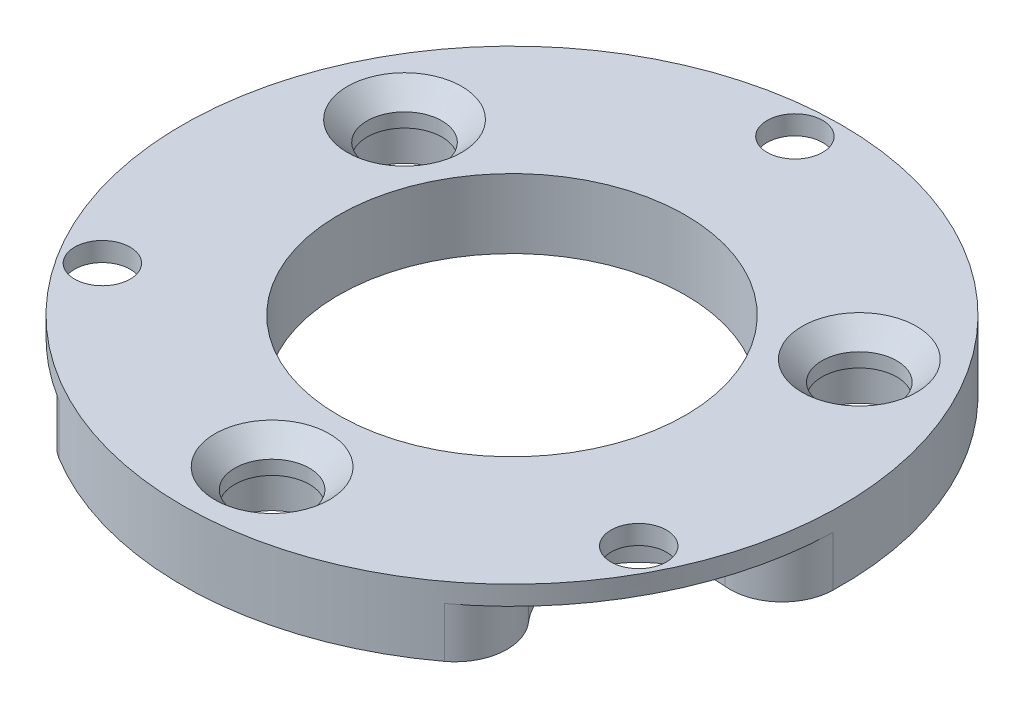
ISO-10303-21;
HEADER;
FILE_DESCRIPTION(('STEP AP214'),'2;1');
FILE_NAME('part.step','',(''),(''),'','','');
FILE_SCHEMA(('AUTOMOTIVE_DESIGN { 1 0 10303 214 1 1 1 1 }'));
ENDSEC;
DATA;
#1=APPLICATION_CONTEXT('core data for automotive mechanical design processes');
#2=APPLICATION_PROTOCOL_DEFINITION('international standard','automotive_design',2000,#1);
#3=PRODUCT_CONTEXT('',#1,'mechanical');
#4=PRODUCT('Part','Part','',(#3));
#5=PRODUCT_RELATED_PRODUCT_CATEGORY('part','',(#4));
#6=PRODUCT_DEFINITION_FORMATION('','',#4);
#7=PRODUCT_DEFINITION_CONTEXT('part definition',#1,'design');
#8=PRODUCT_DEFINITION('design','',#6,#7);
#9=PRODUCT_DEFINITION_SHAPE('','',#8);
#10=(LENGTH_UNIT() NAMED_UNIT(*) SI_UNIT(.MILLI.,.METRE.));
#11=(NAMED_UNIT(*) PLANE_ANGLE_UNIT() SI_UNIT($,.RADIAN.));
#12=(NAMED_UNIT(*) SI_UNIT($,.STERADIAN.) SOLID_ANGLE_UNIT());
#13=UNCERTAINTY_MEASURE_WITH_UNIT(LENGTH_MEASURE(1.E-05),#10,'distance_accuracy_value','');
#14=(GEOMETRIC_REPRESENTATION_CONTEXT(3) GLOBAL_UNCERTAINTY_ASSIGNED_CONTEXT((#13)) GLOBAL_UNIT_ASSIGNED_CONTEXT((#10,
#11,#12)) REPRESENTATION_CONTEXT('',''));
#15=CARTESIAN_POINT('',(0.,0.,0.));
#16=DIRECTION('',(0.,0.,1.));
#17=DIRECTION('',(1.,0.,0.));
#18=AXIS2_PLACEMENT_3D('',#15,#16,#17);
#19=CARTESIAN_POINT('',(1013.64303060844,1021.15951641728,1015.94449769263));
#20=DIRECTION('',(0.,1.,0.));
#21=DIRECTION('',(-0.842589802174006,0.,0.538555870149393));
#22=AXIS2_PLACEMENT_3D('',#19,#20,#21);
#23=CYLINDRICAL_SURFACE('',#22,2.15499999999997);
#24=CARTESIAN_POINT('',(1013.64303060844,1031.22200558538,1015.94449769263));
#25=DIRECTION('',(0.,1.,0.));
#26=DIRECTION('',(0.842589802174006,0.,-0.538555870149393));
#27=AXIS2_PLACEMENT_3D('',#24,#25,#26);
#28=CIRCLE('',#27,2.15499999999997);
#29=CARTESIAN_POINT('',(1015.45881163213,1031.22200558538,1014.78390979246));
#30=VERTEX_POINT('',#29);
#31=EDGE_CURVE('E177',#30,#30,#28,.T.);
#32=ORIENTED_EDGE('',*,*,#31,.T.);
#33=EDGE_LOOP('',(#32));
#34=FACE_BOUND('',#33,.T.);
#35=CARTESIAN_POINT('',(1013.64303060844,1030.41200558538,1015.94449769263));
#36=DIRECTION('',(0.,-1.,0.));
#37=DIRECTION('',(0.842589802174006,0.,-0.538555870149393));
#38=AXIS2_PLACEMENT_3D('',#35,#36,#37);
#39=CIRCLE('',#38,2.15499999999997);
#40=CARTESIAN_POINT('',(1015.45881163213,1030.41200558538,1014.78390979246));
#41=VERTEX_POINT('',#40);
#42=EDGE_CURVE('E262',#41,#41,#39,.T.);
#43=ORIENTED_EDGE('',*,*,#42,.T.);
#44=EDGE_LOOP('',(#43));
#45=FACE_BOUND('',#44,.T.);
#46=ADVANCED_FACE('F17',(#34,#45),#23,.F.);
#47=CARTESIAN_POINT('',(1038.73220324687,1021.15951641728,1014.81161803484));
#48=DIRECTION('',(0.,1.,0.));
#49=DIRECTION('',(-0.842589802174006,0.,0.538555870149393));
#50=AXIS2_PLACEMENT_3D('',#47,#48,#49);
#51=CYLINDRICAL_SURFACE('',#50,2.15499999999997);
#52=CARTESIAN_POINT('',(1038.73220324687,1031.22200558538,1014.81161803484));
#53=DIRECTION('',(0.,1.,0.));
#54=DIRECTION('',(0.842589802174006,0.,-0.538555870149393));
#55=AXIS2_PLACEMENT_3D('',#52,#53,#54);
#56=CIRCLE('',#55,2.15499999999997);
#57=CARTESIAN_POINT('',(1040.54798427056,1031.22200558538,1013.65103013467));
#58=VERTEX_POINT('',#57);
#59=EDGE_CURVE('E199',#58,#58,#56,.T.);
#60=ORIENTED_EDGE('',*,*,#59,.T.);
#61=EDGE_LOOP('',(#60));
#62=FACE_BOUND('',#61,.T.);
#63=CARTESIAN_POINT('',(1038.73220324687,1030.41200558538,1014.81161803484));
#64=DIRECTION('',(0.,-1.,0.));
#65=DIRECTION('',(0.842589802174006,0.,-0.538555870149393));
#66=AXIS2_PLACEMENT_3D('',#63,#64,#65);
#67=CIRCLE('',#66,2.15499999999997);
#68=CARTESIAN_POINT('',(1040.54798427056,1030.41200558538,1013.65103013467));
#69=VERTEX_POINT('',#68);
#70=EDGE_CURVE('E275',#69,#69,#67,.T.);
#71=ORIENTED_EDGE('',*,*,#70,.T.);
#72=EDGE_LOOP('',(#71));
#73=FACE_BOUND('',#72,.T.);
#74=ADVANCED_FACE('F232',(#62,#73),#51,.F.);
#75=CARTESIAN_POINT('',(1027.16871949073,1021.15951641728,1037.10591872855));
#76=DIRECTION('',(0.,1.,0.));
#77=DIRECTION('',(-0.842589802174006,0.,0.538555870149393));
#78=AXIS2_PLACEMENT_3D('',#75,#76,#77);
#79=CYLINDRICAL_SURFACE('',#78,2.15499999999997);
#80=CARTESIAN_POINT('',(1027.16871949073,1031.22200558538,1037.10591872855));
#81=DIRECTION('',(0.,1.,0.));
#82=DIRECTION('',(0.842589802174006,0.,-0.538555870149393));
#83=AXIS2_PLACEMENT_3D('',#80,#81,#82);
#84=CIRCLE('',#83,2.15499999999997);
#85=CARTESIAN_POINT('',(1028.98450051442,1031.22200558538,1035.94533082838));
#86=VERTEX_POINT('',#85);
#87=EDGE_CURVE('E181',#86,#86,#84,.T.);
#88=ORIENTED_EDGE('',*,*,#87,.T.);
#89=EDGE_LOOP('',(#88));
#90=FACE_BOUND('',#89,.T.);
#91=CARTESIAN_POINT('',(1027.16871949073,1030.41200558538,1037.10591872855));
#92=DIRECTION('',(0.,-1.,0.));
#93=DIRECTION('',(0.842589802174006,0.,-0.538555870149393));
#94=AXIS2_PLACEMENT_3D('',#91,#92,#93);
#95=CIRCLE('',#94,2.15499999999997);
#96=CARTESIAN_POINT('',(1028.98450051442,1030.41200558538,1035.94533082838));
#97=VERTEX_POINT('',#96);
#98=EDGE_CURVE('E395',#97,#97,#95,.T.);
#99=ORIENTED_EDGE('',*,*,#98,.T.);
#100=EDGE_LOOP('',(#99));
#101=FACE_BOUND('',#100,.T.);
#102=ADVANCED_FACE('F257',(#90,#101),#79,.F.);
#103=CARTESIAN_POINT('',(1026.51465111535,1039.22200558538,1022.62067815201));
#104=DIRECTION('',(0.,-1.,0.));
#105=DIRECTION('',(0.842589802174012,0.,-0.538555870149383));
#106=AXIS2_PLACEMENT_3D('',#103,#104,#105);
#107=CYLINDRICAL_SURFACE('',#106,19.);
#108=DIRECTION('',(0.,1.,0.));
#109=VECTOR('',#108,1.);
#110=CARTESIAN_POINT('',(1007.64312319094,1039.22200558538,1024.8264509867));
#111=LINE('',#110,#109);
#112=CARTESIAN_POINT('',(1007.64312319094,1028.37200558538,1024.8264509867));
#113=VERTEX_POINT('',#112);
#114=CARTESIAN_POINT('',(1007.64312319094,1031.26200558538,1024.8264509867));
#115=VERTEX_POINT('',#114);
#116=EDGE_CURVE('E11',#113,#115,#111,.T.);
#117=ORIENTED_EDGE('',*,*,#116,.T.);
#118=CARTESIAN_POINT('',(1026.51465111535,1031.26200558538,1022.62067815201));
#119=DIRECTION('',(0.,-1.,0.));
#120=DIRECTION('',(0.842589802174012,0.,-0.538555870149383));
#121=AXIS2_PLACEMENT_3D('',#118,#119,#120);
#122=CIRCLE('',#121,19.);
#123=CARTESIAN_POINT('',(1016.58833202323,1031.26200558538,1038.8215481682));
#124=VERTEX_POINT('',#123);
#125=EDGE_CURVE('E317',#124,#115,#122,.T.);
#126=ORIENTED_EDGE('',*,*,#125,.F.);
#127=DIRECTION('',(0.,-1.,0.));
#128=VECTOR('',#127,1.);
#129=CARTESIAN_POINT('',(1016.58833202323,1039.22200558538,1038.8215481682));
#130=LINE('',#129,#128);
#131=CARTESIAN_POINT('',(1016.58833202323,1028.37200558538,1038.8215481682));
#132=VERTEX_POINT('',#131);
#133=EDGE_CURVE('E309',#124,#132,#130,.T.);
#134=ORIENTED_EDGE('',*,*,#133,.T.);
#135=CARTESIAN_POINT('',(1026.51465111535,1028.37200558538,1022.62067815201));
#136=DIRECTION('',(0.,-1.,0.));
#137=DIRECTION('',(0.842589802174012,0.,-0.538555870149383));
#138=AXIS2_PLACEMENT_3D('',#135,#136,#137);
#139=CIRCLE('',#138,19.);
#140=CARTESIAN_POINT('',(1037.86067038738,1028.37200558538,1037.86101432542));
#141=VERTEX_POINT('',#140);
#142=EDGE_CURVE('E205',#141,#132,#139,.T.);
#143=ORIENTED_EDGE('',*,*,#142,.F.);
#144=DIRECTION('',(0.,1.,0.));
#145=VECTOR('',#144,1.);
#146=CARTESIAN_POINT('',(1037.86067038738,1039.22200558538,1037.86101432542));
#147=LINE('',#146,#145);
#148=CARTESIAN_POINT('',(1037.86067038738,1031.26200558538,1037.86101432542));
#149=VERTEX_POINT('',#148);
#150=EDGE_CURVE('E303',#141,#149,#147,.T.);
#151=ORIENTED_EDGE('',*,*,#150,.T.);
#152=CARTESIAN_POINT('',(1026.51465111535,1031.26200558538,1022.62067815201));
#153=DIRECTION('',(0.,-1.,0.));
#154=DIRECTION('',(0.842589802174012,0.,-0.538555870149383));
#155=AXIS2_PLACEMENT_3D('',#152,#153,#154);
#156=CIRCLE('',#155,19.);
#157=CARTESIAN_POINT('',(1045.50817565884,1031.26200558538,1023.11668764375));
#158=VERTEX_POINT('',#157);
#159=EDGE_CURVE('E325',#158,#149,#156,.T.);
#160=ORIENTED_EDGE('',*,*,#159,.F.);
#161=DIRECTION('',(0.,-1.,0.));
#162=VECTOR('',#161,1.);
#163=CARTESIAN_POINT('',(1045.50817565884,1039.22200558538,1023.11668764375));
#164=LINE('',#163,#162);
#165=CARTESIAN_POINT('',(1045.50817565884,1028.37200558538,1023.11668764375));
#166=VERTEX_POINT('',#165);
#167=EDGE_CURVE('E142',#158,#166,#164,.T.);
#168=ORIENTED_EDGE('',*,*,#167,.T.);
#169=CARTESIAN_POINT('',(1026.51465111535,1028.37200558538,1022.62067815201));
#170=DIRECTION('',(0.,-1.,0.));
#171=DIRECTION('',(0.842589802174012,0.,-0.538555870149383));
#172=AXIS2_PLACEMENT_3D('',#169,#170,#171);
#173=CIRCLE('',#172,19.);
#174=CARTESIAN_POINT('',(1034.04015976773,1028.37200558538,1005.17456914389));
#175=VERTEX_POINT('',#174);
#176=EDGE_CURVE('E133',#175,#166,#173,.T.);
#177=ORIENTED_EDGE('',*,*,#176,.F.);
#178=DIRECTION('',(0.,1.,0.));
#179=VECTOR('',#178,1.);
#180=CARTESIAN_POINT('',(1034.04015976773,1039.22200558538,1005.17456914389));
#181=LINE('',#180,#179);
#182=CARTESIAN_POINT('',(1034.04015976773,1031.26200558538,1005.17456914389));
#183=VERTEX_POINT('',#182);
#184=EDGE_CURVE('E139',#175,#183,#181,.T.);
#185=ORIENTED_EDGE('',*,*,#184,.T.);
#186=CARTESIAN_POINT('',(1026.51465111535,1031.26200558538,1022.62067815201));
#187=DIRECTION('',(0.,-1.,0.));
#188=DIRECTION('',(0.842589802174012,0.,-0.538555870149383));
#189=AXIS2_PLACEMENT_3D('',#186,#187,#188);
#190=CIRCLE('',#189,19.);
#191=CARTESIAN_POINT('',(1017.44744566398,1031.26200558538,1005.92379864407));
#192=VERTEX_POINT('',#191);
#193=EDGE_CURVE('E272',#192,#183,#190,.T.);
#194=ORIENTED_EDGE('',*,*,#193,.F.);
#195=DIRECTION('',(0.,-1.,0.));
#196=VECTOR('',#195,1.);
#197=CARTESIAN_POINT('',(1017.44744566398,1039.22200558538,1005.92379864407));
#198=LINE('',#197,#196);
#199=CARTESIAN_POINT('',(1017.44744566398,1028.37200558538,1005.92379864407));
#200=VERTEX_POINT('',#199);
#201=EDGE_CURVE('E26',#192,#200,#198,.T.);
#202=ORIENTED_EDGE('',*,*,#201,.T.);
#203=CARTESIAN_POINT('',(1026.51465111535,1028.37200558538,1022.62067815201));
#204=DIRECTION('',(0.,-1.,0.));
#205=DIRECTION('',(0.842589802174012,0.,-0.538555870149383));
#206=AXIS2_PLACEMENT_3D('',#203,#204,#205);
#207=CIRCLE('',#206,19.);
#208=EDGE_CURVE('E173',#113,#200,#207,.T.);
#209=ORIENTED_EDGE('',*,*,#208,.F.);
#210=EDGE_LOOP('',(#117,#126,#134,#143,#151,#160,#168,#177,#185,#194,#202,#209));
#211=FACE_BOUND('',#210,.T.);
#212=CARTESIAN_POINT('',(1026.51465111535,1032.36700558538,1022.62067815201));
#213=DIRECTION('',(0.,1.,0.));
#214=DIRECTION('',(-0.842589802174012,0.,0.538555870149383));
#215=AXIS2_PLACEMENT_3D('',#212,#213,#214);
#216=CIRCLE('',#215,19.);
#217=CARTESIAN_POINT('',(1010.50544487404,1032.36700558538,1032.85323968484));
#218=VERTEX_POINT('',#217);
#219=EDGE_CURVE('E190',#218,#218,#216,.T.);
#220=ORIENTED_EDGE('',*,*,#219,.F.);
#221=EDGE_LOOP('',(#220));
#222=FACE_BOUND('',#221,.T.);
#223=ADVANCED_FACE('F135',(#211,#222),#107,.T.);
#224=CARTESIAN_POINT('',(1025.74330151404,1032.36700558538,1005.53808409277));
#225=DIRECTION('',(0.,-1.,0.));
#226=DIRECTION('',(0.842589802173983,0.,-0.538555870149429));
#227=AXIS2_PLACEMENT_3D('',#224,#225,#226);
#228=CYLINDRICAL_SURFACE('',#227,1.59999999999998);
#229=CARTESIAN_POINT('',(1025.74330151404,1031.26200558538,1005.53808409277));
#230=DIRECTION('',(0.,-1.,0.));
#231=DIRECTION('',(0.842589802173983,0.,-0.538555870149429));
#232=AXIS2_PLACEMENT_3D('',#229,#230,#231);
#233=CIRCLE('',#232,1.59999999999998);
#234=CARTESIAN_POINT('',(1027.09144519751,1031.26200558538,1004.67639470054));
#235=VERTEX_POINT('',#234);
#236=EDGE_CURVE('E298',#235,#235,#233,.T.);
#237=ORIENTED_EDGE('',*,*,#236,.T.);
#238=EDGE_LOOP('',(#237));
#239=FACE_BOUND('',#238,.T.);
#240=CARTESIAN_POINT('',(1025.74330151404,1032.36700558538,1005.53808409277));
#241=DIRECTION('',(0.,1.,0.));
#242=DIRECTION('',(-0.842589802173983,0.,0.538555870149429));
#243=AXIS2_PLACEMENT_3D('',#240,#241,#242);
#244=CIRCLE('',#243,1.59999999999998);
#245=CARTESIAN_POINT('',(1024.39515783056,1032.36700558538,1006.39977348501));
#246=VERTEX_POINT('',#245);
#247=EDGE_CURVE('E182',#246,#246,#244,.T.);
#248=ORIENTED_EDGE('',*,*,#247,.T.);
#249=EDGE_LOOP('',(#248));
#250=FACE_BOUND('',#249,.T.);
#251=ADVANCED_FACE('F743',(#239,#250),#228,.F.);
#252=CARTESIAN_POINT('',(1012.10636549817,1032.36700558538,1031.82998353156));
#253=DIRECTION('',(0.,-1.,0.));
#254=DIRECTION('',(0.842589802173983,0.,-0.538555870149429));
#255=AXIS2_PLACEMENT_3D('',#252,#253,#254);
#256=CYLINDRICAL_SURFACE('',#255,1.59999999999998);
#257=CARTESIAN_POINT('',(1012.10636549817,1031.26200558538,1031.82998353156));
#258=DIRECTION('',(0.,-1.,0.));
#259=DIRECTION('',(0.842589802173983,0.,-0.538555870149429));
#260=AXIS2_PLACEMENT_3D('',#257,#258,#259);
#261=CIRCLE('',#260,1.59999999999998);
#262=CARTESIAN_POINT('',(1013.45450918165,1031.26200558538,1030.96829413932));
#263=VERTEX_POINT('',#262);
#264=EDGE_CURVE('E337',#263,#263,#261,.T.);
#265=ORIENTED_EDGE('',*,*,#264,.T.);
#266=EDGE_LOOP('',(#265));
#267=FACE_BOUND('',#266,.T.);
#268=CARTESIAN_POINT('',(1012.10636549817,1032.36700558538,1031.82998353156));
#269=DIRECTION('',(0.,1.,0.));
#270=DIRECTION('',(-0.842589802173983,0.,0.538555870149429));
#271=AXIS2_PLACEMENT_3D('',#268,#269,#270);
#272=CIRCLE('',#271,1.59999999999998);
#273=CARTESIAN_POINT('',(1010.7582218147,1032.36700558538,1032.6916729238));
#274=VERTEX_POINT('',#273);
#275=EDGE_CURVE('E222',#274,#274,#272,.T.);
#276=ORIENTED_EDGE('',*,*,#275,.T.);
#277=EDGE_LOOP('',(#276));
#278=FACE_BOUND('',#277,.T.);
#279=ADVANCED_FACE('F249',(#267,#278),#256,.F.);
#280=CARTESIAN_POINT('',(1041.69428633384,1032.36700558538,1030.49396683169));
#281=DIRECTION('',(0.,-1.,0.));
#282=DIRECTION('',(0.842589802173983,0.,-0.538555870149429));
#283=AXIS2_PLACEMENT_3D('',#280,#281,#282);
#284=CYLINDRICAL_SURFACE('',#283,1.59999999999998);
#285=CARTESIAN_POINT('',(1041.69428633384,1031.26200558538,1030.49396683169));
#286=DIRECTION('',(0.,-1.,0.));
#287=DIRECTION('',(0.842589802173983,0.,-0.538555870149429));
#288=AXIS2_PLACEMENT_3D('',#285,#286,#287);
#289=CIRCLE('',#288,1.59999999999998);
#290=CARTESIAN_POINT('',(1043.04243001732,1031.26200558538,1029.63227743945));
#291=VERTEX_POINT('',#290);
#292=EDGE_CURVE('E357',#291,#291,#289,.T.);
#293=ORIENTED_EDGE('',*,*,#292,.T.);
#294=EDGE_LOOP('',(#293));
#295=FACE_BOUND('',#294,.T.);
#296=CARTESIAN_POINT('',(1041.69428633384,1032.36700558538,1030.49396683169));
#297=DIRECTION('',(0.,1.,0.));
#298=DIRECTION('',(-0.842589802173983,0.,0.538555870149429));
#299=AXIS2_PLACEMENT_3D('',#296,#297,#298);
#300=CIRCLE('',#299,1.59999999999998);
#301=CARTESIAN_POINT('',(1040.34614265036,1032.36700558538,1031.35565622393));
#302=VERTEX_POINT('',#301);
#303=EDGE_CURVE('E218',#302,#302,#300,.T.);
#304=ORIENTED_EDGE('',*,*,#303,.T.);
#305=EDGE_LOOP('',(#304));
#306=FACE_BOUND('',#305,.T.);
#307=ADVANCED_FACE('F238',(#295,#306),#284,.F.);
#308=CARTESIAN_POINT('',(1038.73220324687,1032.36700558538,1014.81161803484));
#309=DIRECTION('',(0.,1.,0.));
#310=DIRECTION('',(-0.842589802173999,0.,0.538555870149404));
#311=AXIS2_PLACEMENT_3D('',#308,#309,#310);
#312=CONICAL_SURFACE('',#311,3.3,0.785398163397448);
#313=CARTESIAN_POINT('',(1038.73220324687,1032.36700558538,1014.81161803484));
#314=DIRECTION('',(0.,1.,0.));
#315=DIRECTION('',(-0.842589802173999,0.,0.538555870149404));
#316=AXIS2_PLACEMENT_3D('',#313,#314,#315);
#317=CIRCLE('',#316,3.3);
#318=CARTESIAN_POINT('',(1035.9516568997,1032.36700558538,1016.58885240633));
#319=VERTEX_POINT('',#318);
#320=EDGE_CURVE('E185',#319,#319,#317,.T.);
#321=ORIENTED_EDGE('',*,*,#320,.T.);
#322=EDGE_LOOP('',(#321));
#323=FACE_BOUND('',#322,.T.);
#324=ORIENTED_EDGE('',*,*,#59,.F.);
#325=EDGE_LOOP('',(#324));
#326=FACE_BOUND('',#325,.T.);
#327=ADVANCED_FACE('F235',(#323,#326),#312,.F.);
#328=CARTESIAN_POINT('',(1027.16871949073,1032.36700558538,1037.10591872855));
#329=DIRECTION('',(0.,1.,0.));
#330=DIRECTION('',(-0.842589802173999,0.,0.538555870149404));
#331=AXIS2_PLACEMENT_3D('',#328,#329,#330);
#332=CONICAL_SURFACE('',#331,3.3,0.785398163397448);
#333=CARTESIAN_POINT('',(1027.16871949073,1032.36700558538,1037.10591872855));
#334=DIRECTION('',(0.,1.,0.));
#335=DIRECTION('',(-0.842589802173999,0.,0.538555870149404));
#336=AXIS2_PLACEMENT_3D('',#333,#334,#335);
#337=CIRCLE('',#336,3.3);
#338=CARTESIAN_POINT('',(1024.38817314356,1032.36700558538,1038.88315310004));
#339=VERTEX_POINT('',#338);
#340=EDGE_CURVE('E189',#339,#339,#337,.T.);
#341=ORIENTED_EDGE('',*,*,#340,.T.);
#342=EDGE_LOOP('',(#341));
#343=FACE_BOUND('',#342,.T.);
#344=ORIENTED_EDGE('',*,*,#87,.F.);
#345=EDGE_LOOP('',(#344));
#346=FACE_BOUND('',#345,.T.);
#347=ADVANCED_FACE('F237',(#343,#346),#332,.F.);
#348=CARTESIAN_POINT('',(1013.64303060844,1032.36700558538,1015.94449769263));
#349=DIRECTION('',(0.,1.,0.));
#350=DIRECTION('',(-0.842589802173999,0.,0.538555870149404));
#351=AXIS2_PLACEMENT_3D('',#348,#349,#350);
#352=CONICAL_SURFACE('',#351,3.3,0.785398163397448);
#353=CARTESIAN_POINT('',(1013.64303060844,1032.36700558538,1015.94449769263));
#354=DIRECTION('',(0.,1.,0.));
#355=DIRECTION('',(-0.842589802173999,0.,0.538555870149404));
#356=AXIS2_PLACEMENT_3D('',#353,#354,#355);
#357=CIRCLE('',#356,3.3);
#358=CARTESIAN_POINT('',(1010.86248426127,1032.36700558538,1017.72173206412));
#359=VERTEX_POINT('',#358);
#360=EDGE_CURVE('E217',#359,#359,#357,.T.);
#361=ORIENTED_EDGE('',*,*,#360,.T.);
#362=EDGE_LOOP('',(#361));
#363=FACE_BOUND('',#362,.T.);
#364=ORIENTED_EDGE('',*,*,#31,.F.);
#365=EDGE_LOOP('',(#364));
#366=FACE_BOUND('',#365,.T.);
#367=ADVANCED_FACE('F246',(#363,#366),#352,.F.);
#368=CARTESIAN_POINT('',(1026.51465111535,1032.36700558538,1022.62067815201));
#369=DIRECTION('',(0.,1.,0.));
#370=DIRECTION('',(1.,0.,0.));
#371=AXIS2_PLACEMENT_3D('',#368,#369,#370);
#372=PLANE('',#371);
#373=ORIENTED_EDGE('',*,*,#247,.F.);
#374=EDGE_LOOP('',(#373));
#375=FACE_BOUND('',#374,.T.);
#376=ORIENTED_EDGE('',*,*,#275,.F.);
#377=EDGE_LOOP('',(#376));
#378=FACE_BOUND('',#377,.T.);
#379=ORIENTED_EDGE('',*,*,#303,.F.);
#380=EDGE_LOOP('',(#379));
#381=FACE_BOUND('',#380,.T.);
#382=CARTESIAN_POINT('',(1026.51465111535,1032.36700558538,1022.62067815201));
#383=DIRECTION('',(0.,1.,0.));
#384=DIRECTION('',(-0.84258980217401,0.,0.538555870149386));
#385=AXIS2_PLACEMENT_3D('',#382,#383,#384);
#386=CIRCLE('',#385,10.0000000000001);
#387=CARTESIAN_POINT('',(1018.08875309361,1032.36700558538,1028.0062368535));
#388=VERTEX_POINT('',#387);
#389=EDGE_CURVE('E206',#388,#388,#386,.T.);
#390=ORIENTED_EDGE('',*,*,#389,.F.);
#391=EDGE_LOOP('',(#390));
#392=FACE_BOUND('',#391,.T.);
#393=ORIENTED_EDGE('',*,*,#360,.F.);
#394=EDGE_LOOP('',(#393));
#395=FACE_BOUND('',#394,.T.);
#396=ORIENTED_EDGE('',*,*,#340,.F.);
#397=EDGE_LOOP('',(#396));
#398=FACE_BOUND('',#397,.T.);
#399=ORIENTED_EDGE('',*,*,#320,.F.);
#400=EDGE_LOOP('',(#399));
#401=FACE_BOUND('',#400,.T.);
#402=ORIENTED_EDGE('',*,*,#219,.T.);
#403=EDGE_LOOP('',(#402));
#404=FACE_BOUND('',#403,.T.);
#405=ADVANCED_FACE('F724',(#375,#378,#381,#392,#395,#398,#401,#404),#372,.T.);
#406=CARTESIAN_POINT('',(1026.51465111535,1032.36700558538,1022.62067815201));
#407=DIRECTION('',(0.,-1.,0.));
#408=DIRECTION('',(0.84258980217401,0.,-0.538555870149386));
#409=AXIS2_PLACEMENT_3D('',#406,#407,#408);
#410=CYLINDRICAL_SURFACE('',#409,10.0000000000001);
#411=CARTESIAN_POINT('',(1026.51465111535,1028.37200558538,1022.62067815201));
#412=DIRECTION('',(0.,1.,0.));
#413=DIRECTION('',(0.84258980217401,0.,-0.538555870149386));
#414=AXIS2_PLACEMENT_3D('',#411,#412,#413);
#415=CIRCLE('',#414,10.0000000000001);
#416=CARTESIAN_POINT('',(1034.94054913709,1028.37200558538,1017.23511945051));
#417=VERTEX_POINT('',#416);
#418=EDGE_CURVE('E210',#417,#417,#415,.T.);
#419=ORIENTED_EDGE('',*,*,#418,.F.);
#420=EDGE_LOOP('',(#419));
#421=FACE_BOUND('',#420,.T.);
#422=ORIENTED_EDGE('',*,*,#389,.T.);
#423=EDGE_LOOP('',(#422));
#424=FACE_BOUND('',#423,.T.);
#425=ADVANCED_FACE('F720',(#421,#424),#410,.F.);
#426=CARTESIAN_POINT('',(1025.74330151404,1031.22200558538,1005.53808409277));
#427=DIRECTION('',(0.,-1.,0.));
#428=DIRECTION('',(0.842589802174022,0.,-0.538555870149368));
#429=AXIS2_PLACEMENT_3D('',#426,#427,#428);
#430=CYLINDRICAL_SURFACE('',#429,4.5);
#431=CARTESIAN_POINT('',(1025.74330151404,1028.37200558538,1005.53808409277));
#432=DIRECTION('',(0.,1.,0.));
#433=DIRECTION('',(0.842589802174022,0.,-0.538555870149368));
#434=AXIS2_PLACEMENT_3D('',#431,#432,#433);
#435=CIRCLE('',#434,4.5);
#436=CARTESIAN_POINT('',(1021.62478641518,1028.37200558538,1007.35132246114));
#437=VERTEX_POINT('',#436);
#438=CARTESIAN_POINT('',(1030.00847354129,1028.37200558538,1006.9727643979));
#439=VERTEX_POINT('',#438);
#440=EDGE_CURVE('E148',#437,#439,#435,.T.);
#441=ORIENTED_EDGE('',*,*,#440,.F.);
#442=DIRECTION('',(0.,1.,0.));
#443=VECTOR('',#442,1.);
#444=CARTESIAN_POINT('',(1021.62478641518,1031.22200558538,1007.35132246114));
#445=LINE('',#444,#443);
#446=CARTESIAN_POINT('',(1021.62478641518,1031.26200558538,1007.35132246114));
#447=VERTEX_POINT('',#446);
#448=EDGE_CURVE('E157',#437,#447,#445,.T.);
#449=ORIENTED_EDGE('',*,*,#448,.T.);
#450=CARTESIAN_POINT('',(1025.74330151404,1031.26200558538,1005.53808409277));
#451=DIRECTION('',(0.,-1.,0.));
#452=DIRECTION('',(0.842589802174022,0.,-0.538555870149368));
#453=AXIS2_PLACEMENT_3D('',#450,#451,#452);
#454=CIRCLE('',#453,4.5);
#455=CARTESIAN_POINT('',(1030.00847354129,1031.26200558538,1006.9727643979));
#456=VERTEX_POINT('',#455);
#457=EDGE_CURVE('E292',#456,#447,#454,.T.);
#458=ORIENTED_EDGE('',*,*,#457,.F.);
#459=DIRECTION('',(0.,-1.,0.));
#460=VECTOR('',#459,1.);
#461=CARTESIAN_POINT('',(1030.00847354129,1031.22200558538,1006.9727643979));
#462=LINE('',#461,#460);
#463=EDGE_CURVE('E164',#456,#439,#462,.T.);
#464=ORIENTED_EDGE('',*,*,#463,.T.);
#465=EDGE_LOOP('',(#441,#449,#458,#464));
#466=FACE_BOUND('',#465,.T.);
#467=ADVANCED_FACE('F716',(#466),#430,.F.);
#468=CARTESIAN_POINT('',(1041.69428633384,1031.22200558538,1030.49396683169));
#469=DIRECTION('',(0.,-1.,0.));
#470=DIRECTION('',(0.842589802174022,0.,-0.538555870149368));
#471=AXIS2_PLACEMENT_3D('',#468,#469,#470);
#472=CYLINDRICAL_SURFACE('',#471,4.5);
#473=DIRECTION('',(0.,1.,0.));
#474=VECTOR('',#473,1.);
#475=CARTESIAN_POINT('',(1042.18323339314,1031.22200558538,1026.02060894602));
#476=LINE('',#475,#474);
#477=CARTESIAN_POINT('',(1042.18323339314,1028.37200558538,1026.02060894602));
#478=VERTEX_POINT('',#477);
#479=CARTESIAN_POINT('',(1042.18323339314,1031.26200558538,1026.02060894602));
#480=VERTEX_POINT('',#479);
#481=EDGE_CURVE('E304',#478,#480,#476,.T.);
#482=ORIENTED_EDGE('',*,*,#481,.T.);
#483=CARTESIAN_POINT('',(1041.69428633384,1031.26200558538,1030.49396683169));
#484=DIRECTION('',(0.,-1.,0.));
#485=DIRECTION('',(0.842589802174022,0.,-0.538555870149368));
#486=AXIS2_PLACEMENT_3D('',#483,#484,#485);
#487=CIRCLE('',#486,4.5);
#488=CARTESIAN_POINT('',(1038.31923072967,1031.26200558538,1033.47037400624));
#489=VERTEX_POINT('',#488);
#490=EDGE_CURVE('E341',#489,#480,#487,.T.);
#491=ORIENTED_EDGE('',*,*,#490,.F.);
#492=DIRECTION('',(0.,-1.,0.));
#493=VECTOR('',#492,1.);
#494=CARTESIAN_POINT('',(1038.31923072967,1031.22200558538,1033.47037400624));
#495=LINE('',#494,#493);
#496=CARTESIAN_POINT('',(1038.31923072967,1028.37200558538,1033.47037400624));
#497=VERTEX_POINT('',#496);
#498=EDGE_CURVE('E299',#489,#497,#495,.T.);
#499=ORIENTED_EDGE('',*,*,#498,.T.);
#500=CARTESIAN_POINT('',(1041.69428633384,1028.37200558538,1030.49396683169));
#501=DIRECTION('',(0.,1.,0.));
#502=DIRECTION('',(0.842589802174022,0.,-0.538555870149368));
#503=AXIS2_PLACEMENT_3D('',#500,#501,#502);
#504=CIRCLE('',#503,4.5);
#505=EDGE_CURVE('E147',#478,#497,#504,.T.);
#506=ORIENTED_EDGE('',*,*,#505,.F.);
#507=EDGE_LOOP('',(#482,#491,#499,#506));
#508=FACE_BOUND('',#507,.T.);
#509=ADVANCED_FACE('F713',(#508),#472,.F.);
#510=CARTESIAN_POINT('',(1012.10636549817,1031.22200558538,1031.82998353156));
#511=DIRECTION('',(0.,-1.,0.));
#512=DIRECTION('',(0.842589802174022,0.,-0.538555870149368));
#513=AXIS2_PLACEMENT_3D('',#510,#511,#512);
#514=CYLINDRICAL_SURFACE('',#513,4.5);
#515=DIRECTION('',(0.,-1.,0.));
#516=VECTOR('',#515,1.);
#517=CARTESIAN_POINT('',(1011.21624907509,1031.22200558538,1027.41889605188));
#518=LINE('',#517,#516);
#519=CARTESIAN_POINT('',(1011.21624907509,1031.26200558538,1027.41889605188));
#520=VERTEX_POINT('',#519);
#521=CARTESIAN_POINT('',(1011.21624907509,1028.37200558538,1027.41889605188));
#522=VERTEX_POINT('',#521);
#523=EDGE_CURVE('E324',#520,#522,#518,.T.);
#524=ORIENTED_EDGE('',*,*,#523,.T.);
#525=CARTESIAN_POINT('',(1012.10636549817,1028.37200558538,1031.82998353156));
#526=DIRECTION('',(0.,1.,0.));
#527=DIRECTION('',(0.842589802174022,0.,-0.538555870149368));
#528=AXIS2_PLACEMENT_3D('',#525,#526,#527);
#529=CIRCLE('',#528,4.5);
#530=CARTESIAN_POINT('',(1015.73593353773,1028.37200558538,1034.49010304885));
#531=VERTEX_POINT('',#530);
#532=EDGE_CURVE('E285',#531,#522,#529,.T.);
#533=ORIENTED_EDGE('',*,*,#532,.F.);
#534=DIRECTION('',(0.,1.,0.));
#535=VECTOR('',#534,1.);
#536=CARTESIAN_POINT('',(1015.73593353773,1031.22200558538,1034.49010304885));
#537=LINE('',#536,#535);
#538=CARTESIAN_POINT('',(1015.73593353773,1031.26200558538,1034.49010304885));
#539=VERTEX_POINT('',#538);
#540=EDGE_CURVE('E170',#531,#539,#537,.T.);
#541=ORIENTED_EDGE('',*,*,#540,.T.);
#542=CARTESIAN_POINT('',(1012.10636549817,1031.26200558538,1031.82998353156));
#543=DIRECTION('',(0.,-1.,0.));
#544=DIRECTION('',(0.842589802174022,0.,-0.538555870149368));
#545=AXIS2_PLACEMENT_3D('',#542,#543,#544);
#546=CIRCLE('',#545,4.5);
#547=EDGE_CURVE('E334',#520,#539,#546,.T.);
#548=ORIENTED_EDGE('',*,*,#547,.F.);
#549=EDGE_LOOP('',(#524,#533,#541,#548));
#550=FACE_BOUND('',#549,.T.);
#551=ADVANCED_FACE('F407',(#550),#514,.F.);
#552=CARTESIAN_POINT('',(1026.51465111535,1028.37200558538,1022.62067815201));
#553=DIRECTION('',(0.,-1.,0.));
#554=DIRECTION('',(0.,0.,-1.));
#555=AXIS2_PLACEMENT_3D('',#552,#553,#554);
#556=PLANE('',#555);
#557=CARTESIAN_POINT('',(1013.64303060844,1028.37200558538,1015.94449769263));
#558=DIRECTION('',(0.,-1.,0.));
#559=DIRECTION('',(0.842589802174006,0.,-0.538555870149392));
#560=AXIS2_PLACEMENT_3D('',#557,#558,#559);
#561=CIRCLE('',#560,2.55000000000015);
#562=CARTESIAN_POINT('',(1015.79163460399,1028.37200558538,1014.57118022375));
#563=VERTEX_POINT('',#562);
#564=EDGE_CURVE('E196',#563,#563,#561,.T.);
#565=ORIENTED_EDGE('',*,*,#564,.F.);
#566=EDGE_LOOP('',(#565));
#567=FACE_BOUND('',#566,.T.);
#568=CARTESIAN_POINT('',(1027.16871949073,1028.37200558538,1037.10591872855));
#569=DIRECTION('',(0.,-1.,0.));
#570=DIRECTION('',(0.842589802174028,0.,-0.538555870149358));
#571=AXIS2_PLACEMENT_3D('',#568,#569,#570);
#572=CIRCLE('',#571,2.55000000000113);
#573=CARTESIAN_POINT('',(1029.31732348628,1028.37200558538,1035.73260125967));
#574=VERTEX_POINT('',#573);
#575=EDGE_CURVE('E195',#574,#574,#572,.T.);
#576=ORIENTED_EDGE('',*,*,#575,.F.);
#577=EDGE_LOOP('',(#576));
#578=FACE_BOUND('',#577,.T.);
#579=CARTESIAN_POINT('',(1038.73220324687,1028.37200558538,1014.81161803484));
#580=DIRECTION('',(0.,-1.,0.));
#581=DIRECTION('',(0.842589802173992,0.,-0.538555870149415));
#582=AXIS2_PLACEMENT_3D('',#579,#580,#581);
#583=CIRCLE('',#582,2.55000000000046);
#584=CARTESIAN_POINT('',(1040.88080724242,1028.37200558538,1013.43830056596));
#585=VERTEX_POINT('',#584);
#586=EDGE_CURVE('E191',#585,#585,#583,.T.);
#587=ORIENTED_EDGE('',*,*,#586,.F.);
#588=EDGE_LOOP('',(#587));
#589=FACE_BOUND('',#588,.T.);
#590=ORIENTED_EDGE('',*,*,#418,.T.);
#591=EDGE_LOOP('',(#590));
#592=FACE_BOUND('',#591,.T.);
#593=ORIENTED_EDGE('',*,*,#208,.T.);
#594=CARTESIAN_POINT('',(1018.87910968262,1028.37200558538,1008.56014804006));
#595=DIRECTION('',(0.,-1.,0.));
#596=DIRECTION('',(0.842589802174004,0.,-0.538555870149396));
#597=AXIS2_PLACEMENT_3D('',#594,#595,#596);
#598=CIRCLE('',#597,3.);
#599=EDGE_CURVE('E39',#200,#437,#598,.T.);
#600=ORIENTED_EDGE('',*,*,#599,.T.);
#601=ORIENTED_EDGE('',*,*,#440,.T.);
#602=CARTESIAN_POINT('',(1032.85192155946,1028.37200558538,1007.92921793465));
#603=DIRECTION('',(0.,-1.,0.));
#604=DIRECTION('',(0.842589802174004,0.,-0.538555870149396));
#605=AXIS2_PLACEMENT_3D('',#602,#603,#604);
#606=CIRCLE('',#605,3.);
#607=EDGE_CURVE('E151',#439,#175,#606,.T.);
#608=ORIENTED_EDGE('',*,*,#607,.T.);
#609=ORIENTED_EDGE('',*,*,#176,.T.);
#610=CARTESIAN_POINT('',(1042.50919809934,1028.37200558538,1023.03837035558));
#611=DIRECTION('',(0.,-1.,0.));
#612=DIRECTION('',(0.842589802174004,0.,-0.538555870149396));
#613=AXIS2_PLACEMENT_3D('',#610,#611,#612);
#614=CIRCLE('',#613,3.);
#615=EDGE_CURVE('E361',#166,#478,#614,.T.);
#616=ORIENTED_EDGE('',*,*,#615,.T.);
#617=ORIENTED_EDGE('',*,*,#505,.T.);
#618=CARTESIAN_POINT('',(1036.06919366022,1028.37200558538,1035.45464545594));
#619=DIRECTION('',(0.,-1.,0.));
#620=DIRECTION('',(0.842589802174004,0.,-0.538555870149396));
#621=AXIS2_PLACEMENT_3D('',#618,#619,#620);
#622=CIRCLE('',#621,3.);
#623=EDGE_CURVE('E370',#497,#141,#622,.T.);
#624=ORIENTED_EDGE('',*,*,#623,.T.);
#625=ORIENTED_EDGE('',*,*,#142,.T.);
#626=CARTESIAN_POINT('',(1018.15564556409,1028.37200558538,1036.26351606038));
#627=DIRECTION('',(0.,-1.,0.));
#628=DIRECTION('',(0.842589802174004,0.,-0.538555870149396));
#629=AXIS2_PLACEMENT_3D('',#626,#627,#628);
#630=CIRCLE('',#629,3.);
#631=EDGE_CURVE('E313',#132,#531,#630,.T.);
#632=ORIENTED_EDGE('',*,*,#631,.T.);
#633=ORIENTED_EDGE('',*,*,#532,.T.);
#634=CARTESIAN_POINT('',(1010.62283812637,1028.37200558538,1024.47817106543));
#635=DIRECTION('',(0.,-1.,0.));
#636=DIRECTION('',(0.842589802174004,0.,-0.538555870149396));
#637=AXIS2_PLACEMENT_3D('',#634,#635,#636);
#638=CIRCLE('',#637,3.);
#639=EDGE_CURVE('E374',#522,#113,#638,.T.);
#640=ORIENTED_EDGE('',*,*,#639,.T.);
#641=EDGE_LOOP('',(#593,#600,#601,#608,#609,#616,#617,#624,#625,#632,#633,#640));
#642=FACE_BOUND('',#641,.T.);
#643=ADVANCED_FACE('F153',(#567,#578,#589,#592,#642),#556,.T.);
#644=CARTESIAN_POINT('',(1027.16871949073,1030.37200558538,1037.10591872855));
#645=DIRECTION('',(0.,-1.,0.));
#646=DIRECTION('',(0.842589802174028,0.,-0.538555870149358));
#647=AXIS2_PLACEMENT_3D('',#644,#645,#646);
#648=CYLINDRICAL_SURFACE('',#647,2.55000000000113);
#649=ORIENTED_EDGE('',*,*,#575,.T.);
#650=EDGE_LOOP('',(#649));
#651=FACE_BOUND('',#650,.T.);
#652=CARTESIAN_POINT('',(1027.16871949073,1030.41200558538,1037.10591872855));
#653=DIRECTION('',(0.,-1.,0.));
#654=DIRECTION('',(0.842589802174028,0.,-0.538555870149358));
#655=AXIS2_PLACEMENT_3D('',#652,#653,#654);
#656=CIRCLE('',#655,2.55000000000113);
#657=CARTESIAN_POINT('',(1029.31732348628,1030.41200558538,1035.73260125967));
#658=VERTEX_POINT('',#657);
#659=EDGE_CURVE('E641',#658,#658,#656,.T.);
#660=ORIENTED_EDGE('',*,*,#659,.F.);
#661=EDGE_LOOP('',(#660));
#662=FACE_BOUND('',#661,.T.);
#663=ADVANCED_FACE('F695',(#651,#662),#648,.F.);
#664=CARTESIAN_POINT('',(1038.73220324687,1030.37200558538,1014.81161803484));
#665=DIRECTION('',(0.,-1.,0.));
#666=DIRECTION('',(0.842589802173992,0.,-0.538555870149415));
#667=AXIS2_PLACEMENT_3D('',#664,#665,#666);
#668=CYLINDRICAL_SURFACE('',#667,2.55000000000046);
#669=ORIENTED_EDGE('',*,*,#586,.T.);
#670=EDGE_LOOP('',(#669));
#671=FACE_BOUND('',#670,.T.);
#672=CARTESIAN_POINT('',(1038.73220324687,1030.41200558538,1014.81161803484));
#673=DIRECTION('',(0.,-1.,0.));
#674=DIRECTION('',(0.842589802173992,0.,-0.538555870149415));
#675=AXIS2_PLACEMENT_3D('',#672,#673,#674);
#676=CIRCLE('',#675,2.55000000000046);
#677=CARTESIAN_POINT('',(1040.88080724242,1030.41200558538,1013.43830056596));
#678=VERTEX_POINT('',#677);
#679=EDGE_CURVE('E391',#678,#678,#676,.T.);
#680=ORIENTED_EDGE('',*,*,#679,.F.);
#681=EDGE_LOOP('',(#680));
#682=FACE_BOUND('',#681,.T.);
#683=ADVANCED_FACE('F697',(#671,#682),#668,.F.);
#684=CARTESIAN_POINT('',(1013.64303060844,1030.37200558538,1015.94449769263));
#685=DIRECTION('',(0.,-1.,0.));
#686=DIRECTION('',(0.842589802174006,0.,-0.538555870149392));
#687=AXIS2_PLACEMENT_3D('',#684,#685,#686);
#688=CYLINDRICAL_SURFACE('',#687,2.55000000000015);
#689=ORIENTED_EDGE('',*,*,#564,.T.);
#690=EDGE_LOOP('',(#689));
#691=FACE_BOUND('',#690,.T.);
#692=CARTESIAN_POINT('',(1013.64303060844,1030.41200558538,1015.94449769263));
#693=DIRECTION('',(0.,-1.,0.));
#694=DIRECTION('',(0.842589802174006,0.,-0.538555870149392));
#695=AXIS2_PLACEMENT_3D('',#692,#693,#694);
#696=CIRCLE('',#695,2.55000000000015);
#697=CARTESIAN_POINT('',(1015.79163460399,1030.41200558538,1014.57118022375));
#698=VERTEX_POINT('',#697);
#699=EDGE_CURVE('E266',#698,#698,#696,.T.);
#700=ORIENTED_EDGE('',*,*,#699,.F.);
#701=EDGE_LOOP('',(#700));
#702=FACE_BOUND('',#701,.T.);
#703=ADVANCED_FACE('F704',(#691,#702),#688,.F.);
#704=CARTESIAN_POINT('',(1018.87910968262,1039.22200558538,1008.56014804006));
#705=DIRECTION('',(0.,-1.,0.));
#706=DIRECTION('',(0.842589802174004,0.,-0.538555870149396));
#707=AXIS2_PLACEMENT_3D('',#704,#705,#706);
#708=CYLINDRICAL_SURFACE('',#707,3.);
#709=ORIENTED_EDGE('',*,*,#599,.F.);
#710=ORIENTED_EDGE('',*,*,#201,.F.);
#711=CARTESIAN_POINT('',(1018.87910968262,1031.26200558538,1008.56014804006));
#712=DIRECTION('',(0.,1.,0.));
#713=DIRECTION('',(0.842589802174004,0.,-0.538555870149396));
#714=AXIS2_PLACEMENT_3D('',#711,#712,#713);
#715=CIRCLE('',#714,3.);
#716=EDGE_CURVE('E265',#447,#192,#715,.T.);
#717=ORIENTED_EDGE('',*,*,#716,.F.);
#718=ORIENTED_EDGE('',*,*,#448,.F.);
#719=EDGE_LOOP('',(#709,#710,#717,#718));
#720=FACE_BOUND('',#719,.T.);
#721=ADVANCED_FACE('F799',(#720),#708,.T.);
#722=CARTESIAN_POINT('',(1032.85192155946,1039.22200558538,1007.92921793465));
#723=DIRECTION('',(0.,1.,0.));
#724=DIRECTION('',(-0.842589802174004,0.,0.538555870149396));
#725=AXIS2_PLACEMENT_3D('',#722,#723,#724);
#726=CYLINDRICAL_SURFACE('',#725,3.);
#727=ORIENTED_EDGE('',*,*,#463,.F.);
#728=CARTESIAN_POINT('',(1032.85192155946,1031.26200558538,1007.92921793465));
#729=DIRECTION('',(0.,1.,0.));
#730=DIRECTION('',(0.842589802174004,0.,-0.538555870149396));
#731=AXIS2_PLACEMENT_3D('',#728,#729,#730);
#732=CIRCLE('',#731,3.);
#733=EDGE_CURVE('E161',#183,#456,#732,.T.);
#734=ORIENTED_EDGE('',*,*,#733,.F.);
#735=ORIENTED_EDGE('',*,*,#184,.F.);
#736=ORIENTED_EDGE('',*,*,#607,.F.);
#737=EDGE_LOOP('',(#727,#734,#735,#736));
#738=FACE_BOUND('',#737,.T.);
#739=ADVANCED_FACE('F159',(#738),#726,.T.);
#740=CARTESIAN_POINT('',(1018.15564556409,1039.22200558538,1036.26351606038));
#741=DIRECTION('',(0.,-1.,0.));
#742=DIRECTION('',(0.842589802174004,0.,-0.538555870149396));
#743=AXIS2_PLACEMENT_3D('',#740,#741,#742);
#744=CYLINDRICAL_SURFACE('',#743,3.);
#745=ORIENTED_EDGE('',*,*,#631,.F.);
#746=ORIENTED_EDGE('',*,*,#133,.F.);
#747=CARTESIAN_POINT('',(1018.15564556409,1031.26200558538,1036.26351606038));
#748=DIRECTION('',(0.,1.,0.));
#749=DIRECTION('',(0.842589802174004,0.,-0.538555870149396));
#750=AXIS2_PLACEMENT_3D('',#747,#748,#749);
#751=CIRCLE('',#750,3.);
#752=EDGE_CURVE('E308',#539,#124,#751,.T.);
#753=ORIENTED_EDGE('',*,*,#752,.F.);
#754=ORIENTED_EDGE('',*,*,#540,.F.);
#755=EDGE_LOOP('',(#745,#746,#753,#754));
#756=FACE_BOUND('',#755,.T.);
#757=ADVANCED_FACE('F413',(#756),#744,.T.);
#758=CARTESIAN_POINT('',(1010.62283812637,1039.22200558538,1024.47817106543));
#759=DIRECTION('',(0.,1.,0.));
#760=DIRECTION('',(-0.842589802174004,0.,0.538555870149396));
#761=AXIS2_PLACEMENT_3D('',#758,#759,#760);
#762=CYLINDRICAL_SURFACE('',#761,3.);
#763=ORIENTED_EDGE('',*,*,#523,.F.);
#764=CARTESIAN_POINT('',(1010.62283812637,1031.26200558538,1024.47817106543));
#765=DIRECTION('',(0.,1.,0.));
#766=DIRECTION('',(0.842589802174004,0.,-0.538555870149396));
#767=AXIS2_PLACEMENT_3D('',#764,#765,#766);
#768=CIRCLE('',#767,3.);
#769=EDGE_CURVE('E320',#115,#520,#768,.T.);
#770=ORIENTED_EDGE('',*,*,#769,.F.);
#771=ORIENTED_EDGE('',*,*,#116,.F.);
#772=ORIENTED_EDGE('',*,*,#639,.F.);
#773=EDGE_LOOP('',(#763,#770,#771,#772));
#774=FACE_BOUND('',#773,.T.);
#775=ADVANCED_FACE('F406',(#774),#762,.T.);
#776=CARTESIAN_POINT('',(1036.06919366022,1039.22200558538,1035.45464545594));
#777=DIRECTION('',(0.,1.,0.));
#778=DIRECTION('',(-0.842589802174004,0.,0.538555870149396));
#779=AXIS2_PLACEMENT_3D('',#776,#777,#778);
#780=CYLINDRICAL_SURFACE('',#779,3.);
#781=ORIENTED_EDGE('',*,*,#498,.F.);
#782=CARTESIAN_POINT('',(1036.06919366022,1031.26200558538,1035.45464545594));
#783=DIRECTION('',(0.,1.,0.));
#784=DIRECTION('',(0.842589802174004,0.,-0.538555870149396));
#785=AXIS2_PLACEMENT_3D('',#782,#783,#784);
#786=CIRCLE('',#785,3.);
#787=EDGE_CURVE('E329',#149,#489,#786,.T.);
#788=ORIENTED_EDGE('',*,*,#787,.F.);
#789=ORIENTED_EDGE('',*,*,#150,.F.);
#790=ORIENTED_EDGE('',*,*,#623,.F.);
#791=EDGE_LOOP('',(#781,#788,#789,#790));
#792=FACE_BOUND('',#791,.T.);
#793=ADVANCED_FACE('F790',(#792),#780,.T.);
#794=CARTESIAN_POINT('',(1042.50919809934,1039.22200558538,1023.03837035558));
#795=DIRECTION('',(0.,-1.,0.));
#796=DIRECTION('',(0.842589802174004,0.,-0.538555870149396));
#797=AXIS2_PLACEMENT_3D('',#794,#795,#796);
#798=CYLINDRICAL_SURFACE('',#797,3.);
#799=ORIENTED_EDGE('',*,*,#615,.F.);
#800=ORIENTED_EDGE('',*,*,#167,.F.);
#801=CARTESIAN_POINT('',(1042.50919809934,1031.26200558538,1023.03837035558));
#802=DIRECTION('',(0.,1.,0.));
#803=DIRECTION('',(0.842589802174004,0.,-0.538555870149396));
#804=AXIS2_PLACEMENT_3D('',#801,#802,#803);
#805=CIRCLE('',#804,3.);
#806=EDGE_CURVE('E330',#480,#158,#805,.T.);
#807=ORIENTED_EDGE('',*,*,#806,.F.);
#808=ORIENTED_EDGE('',*,*,#481,.F.);
#809=EDGE_LOOP('',(#799,#800,#807,#808));
#810=FACE_BOUND('',#809,.T.);
#811=ADVANCED_FACE('F780',(#810),#798,.T.);
#812=CARTESIAN_POINT('',(1042.10174221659,1031.26200558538,1026.76616859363));
#813=DIRECTION('',(0.,-1.,0.));
#814=DIRECTION('',(0.,0.,-1.));
#815=AXIS2_PLACEMENT_3D('',#812,#813,#814);
#816=PLANE('',#815);
#817=ORIENTED_EDGE('',*,*,#292,.F.);
#818=EDGE_LOOP('',(#817));
#819=FACE_BOUND('',#818,.T.);
#820=ORIENTED_EDGE('',*,*,#806,.T.);
#821=ORIENTED_EDGE('',*,*,#159,.T.);
#822=ORIENTED_EDGE('',*,*,#787,.T.);
#823=ORIENTED_EDGE('',*,*,#490,.T.);
#824=EDGE_LOOP('',(#820,#821,#822,#823));
#825=FACE_BOUND('',#824,.T.);
#826=ADVANCED_FACE('F771',(#819,#825),#816,.T.);
#827=CARTESIAN_POINT('',(1015.13100553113,1031.26200558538,1034.04674979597));
#828=DIRECTION('',(0.,-1.,0.));
#829=DIRECTION('',(0.,0.,-1.));
#830=AXIS2_PLACEMENT_3D('',#827,#828,#829);
#831=PLANE('',#830);
#832=ORIENTED_EDGE('',*,*,#264,.F.);
#833=EDGE_LOOP('',(#832));
#834=FACE_BOUND('',#833,.T.);
#835=ORIENTED_EDGE('',*,*,#752,.T.);
#836=ORIENTED_EDGE('',*,*,#125,.T.);
#837=ORIENTED_EDGE('',*,*,#769,.T.);
#838=ORIENTED_EDGE('',*,*,#547,.T.);
#839=EDGE_LOOP('',(#835,#836,#837,#838));
#840=FACE_BOUND('',#839,.T.);
#841=ADVANCED_FACE('F402',(#834,#840),#831,.T.);
#842=CARTESIAN_POINT('',(1022.31120559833,1031.26200558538,1007.04911606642));
#843=DIRECTION('',(0.,-1.,0.));
#844=DIRECTION('',(0.,0.,-1.));
#845=AXIS2_PLACEMENT_3D('',#842,#843,#844);
#846=PLANE('',#845);
#847=ORIENTED_EDGE('',*,*,#236,.F.);
#848=EDGE_LOOP('',(#847));
#849=FACE_BOUND('',#848,.T.);
#850=ORIENTED_EDGE('',*,*,#716,.T.);
#851=ORIENTED_EDGE('',*,*,#193,.T.);
#852=ORIENTED_EDGE('',*,*,#733,.T.);
#853=ORIENTED_EDGE('',*,*,#457,.T.);
#854=EDGE_LOOP('',(#850,#851,#852,#853));
#855=FACE_BOUND('',#854,.T.);
#856=ADVANCED_FACE('F770',(#849,#855),#846,.T.);
#857=CARTESIAN_POINT('',(1013.64303060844,1030.41200558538,1015.94449769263));
#858=DIRECTION('',(0.,-1.,0.));
#859=DIRECTION('',(0.,0.,-1.));
#860=AXIS2_PLACEMENT_3D('',#857,#858,#859);
#861=PLANE('',#860);
#862=ORIENTED_EDGE('',*,*,#42,.F.);
#863=EDGE_LOOP('',(#862));
#864=FACE_BOUND('',#863,.T.);
#865=ORIENTED_EDGE('',*,*,#699,.T.);
#866=EDGE_LOOP('',(#865));
#867=FACE_BOUND('',#866,.T.);
#868=ADVANCED_FACE('F777',(#864,#867),#861,.T.);
#869=CARTESIAN_POINT('',(1038.73220324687,1030.41200558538,1014.81161803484));
#870=DIRECTION('',(0.,-1.,0.));
#871=DIRECTION('',(0.,0.,-1.));
#872=AXIS2_PLACEMENT_3D('',#869,#870,#871);
#873=PLANE('',#872);
#874=ORIENTED_EDGE('',*,*,#70,.F.);
#875=EDGE_LOOP('',(#874));
#876=FACE_BOUND('',#875,.T.);
#877=ORIENTED_EDGE('',*,*,#679,.T.);
#878=EDGE_LOOP('',(#877));
#879=FACE_BOUND('',#878,.T.);
#880=ADVANCED_FACE('F785',(#876,#879),#873,.T.);
#881=CARTESIAN_POINT('',(1027.16871949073,1030.41200558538,1037.10591872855));
#882=DIRECTION('',(0.,-1.,0.));
#883=DIRECTION('',(0.,0.,-1.));
#884=AXIS2_PLACEMENT_3D('',#881,#882,#883);
#885=PLANE('',#884);
#886=ORIENTED_EDGE('',*,*,#98,.F.);
#887=EDGE_LOOP('',(#886));
#888=FACE_BOUND('',#887,.T.);
#889=ORIENTED_EDGE('',*,*,#659,.T.);
#890=EDGE_LOOP('',(#889));
#891=FACE_BOUND('',#890,.T.);
#892=ADVANCED_FACE('F693',(#888,#891),#885,.T.);
#893=CLOSED_SHELL('',(#46,#74,#102,#223,#251,#279,#307,#327,#347,#367,#405,#425,#467,#509,#551,
#643,#663,#683,#703,#721,#739,#757,#775,#793,#811,#826,#841,#856,#868,#880,#892));
#894=MANIFOLD_SOLID_BREP('B1',#893);
#895=ADVANCED_BREP_SHAPE_REPRESENTATION('',(#18,#894),#14);
#896=SHAPE_DEFINITION_REPRESENTATION(#9,#895);
ENDSEC;
END-ISO-10303-21;
